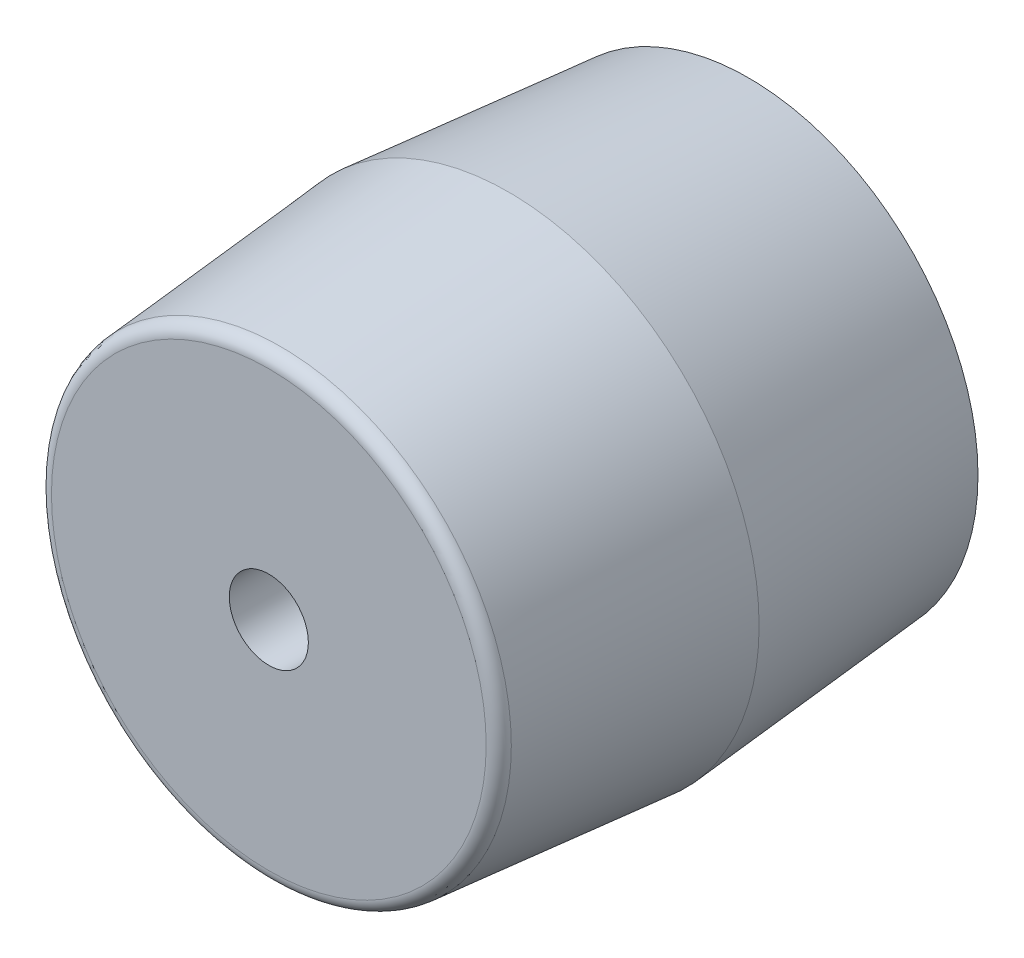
from build123d import *

# Parameters (mm, degrees)
SKETCH1_R                     = 9.5
BOSS_EXTRUDE1_DEPTH           = 9.1
BOSS_EXTRUDE1_TAPER           = 5
BOSS_EXTRUDE1_OTHER_WAY_DEPTH = 9.1
BOSS_EXTRUDE1_OTHER_WAY_TAPER = 5
FILLET1_R                     = 0.5
SKETCH2_R                     = 1.5
CUT_EXTRUDE1_DEPTH            = 18.5


with BuildPart() as part:
    # Sketch1 → Boss-Extrude1 (new body)
    with BuildSketch(Plane.XY):
        Circle(SKETCH1_R)
    extrude(amount=BOSS_EXTRUDE1_DEPTH, taper=BOSS_EXTRUDE1_TAPER)

    # Sketch1 → Boss-Extrude1 other way (add)
    with BuildSketch(Plane.XY):
        Circle(SKETCH1_R)
    extrude(amount=-BOSS_EXTRUDE1_OTHER_WAY_DEPTH, taper=BOSS_EXTRUDE1_OTHER_WAY_TAPER)

    # Fillet1
    fillet1_edges = [part.edges().sort_by_distance(p)[0] for p in [
        (-8.703853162, 0, 9.1),
    ]]
    fillet(fillet1_edges, radius=FILLET1_R)

    # Sketch2 → Cut-Extrude1 (cut)
    with BuildSketch(Plane.XY.offset(9.1)):
        Circle(SKETCH2_R)
    extrude(amount=-CUT_EXTRUDE1_DEPTH, mode=Mode.SUBTRACT)


solid = part.part
